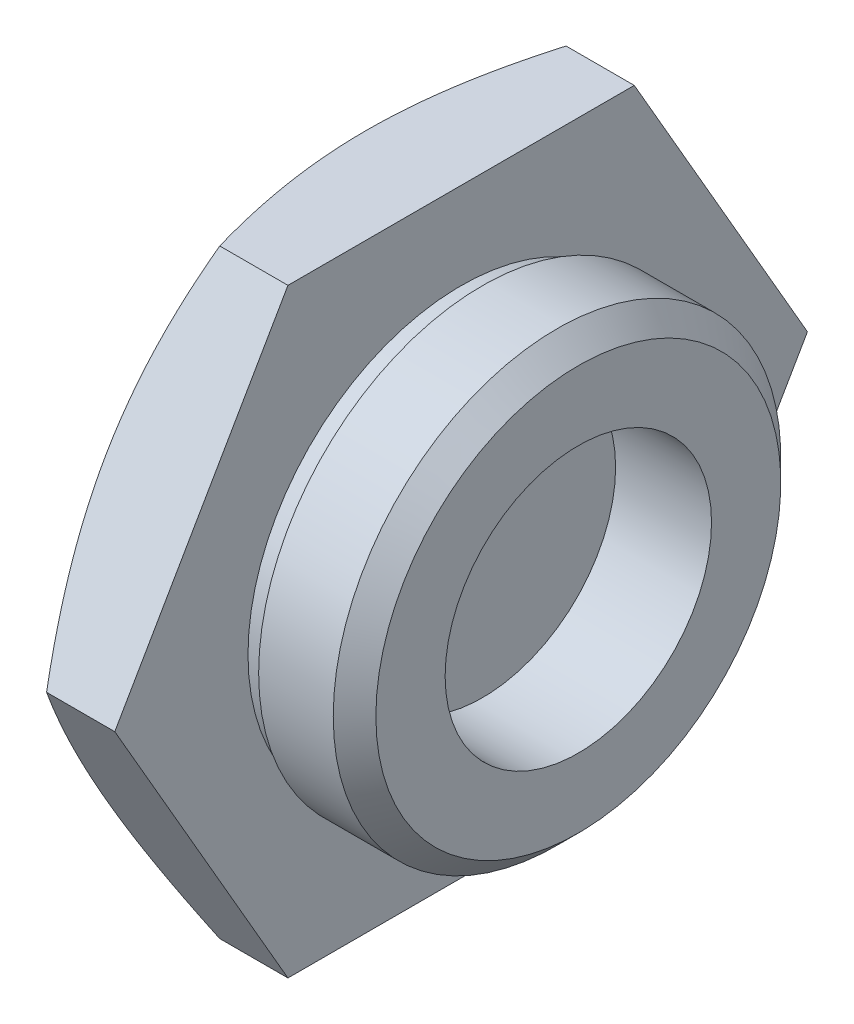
ISO-10303-21;
HEADER;
FILE_DESCRIPTION(('STEP AP214'),'2;1');
FILE_NAME('part.step','',(''),(''),'','','');
FILE_SCHEMA(('AUTOMOTIVE_DESIGN { 1 0 10303 214 1 1 1 1 }'));
ENDSEC;
DATA;
#1=APPLICATION_CONTEXT('core data for automotive mechanical design processes');
#2=APPLICATION_PROTOCOL_DEFINITION('international standard','automotive_design',2000,#1);
#3=PRODUCT_CONTEXT('',#1,'mechanical');
#4=PRODUCT('Part','Part','',(#3));
#5=PRODUCT_RELATED_PRODUCT_CATEGORY('part','',(#4));
#6=PRODUCT_DEFINITION_FORMATION('','',#4);
#7=PRODUCT_DEFINITION_CONTEXT('part definition',#1,'design');
#8=PRODUCT_DEFINITION('design','',#6,#7);
#9=PRODUCT_DEFINITION_SHAPE('','',#8);
#10=(LENGTH_UNIT() NAMED_UNIT(*) SI_UNIT(.MILLI.,.METRE.));
#11=(NAMED_UNIT(*) PLANE_ANGLE_UNIT() SI_UNIT($,.RADIAN.));
#12=(NAMED_UNIT(*) SI_UNIT($,.STERADIAN.) SOLID_ANGLE_UNIT());
#13=UNCERTAINTY_MEASURE_WITH_UNIT(LENGTH_MEASURE(1.E-05),#10,'distance_accuracy_value','');
#14=(GEOMETRIC_REPRESENTATION_CONTEXT(3) GLOBAL_UNCERTAINTY_ASSIGNED_CONTEXT((#13)) GLOBAL_UNIT_ASSIGNED_CONTEXT((#10,
#11,#12)) REPRESENTATION_CONTEXT('',''));
#15=CARTESIAN_POINT('',(0.,0.,0.));
#16=DIRECTION('',(0.,0.,1.));
#17=DIRECTION('',(1.,0.,0.));
#18=AXIS2_PLACEMENT_3D('',#15,#16,#17);
#19=CARTESIAN_POINT('',(-9.,-28.1458256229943,16.25));
#20=DIRECTION('',(0.,0.5,-0.866025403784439));
#21=DIRECTION('',(0.,0.866025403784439,0.5));
#22=AXIS2_PLACEMENT_3D('',#19,#20,#21);
#23=PLANE('',#22);
#24=CARTESIAN_POINT('',(-6.40185712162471,-28.1460256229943,16.2498845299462));
#25=CARTESIAN_POINT('',(-6.60805259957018,-27.5273929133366,16.6070522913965));
#26=CARTESIAN_POINT('',(-6.80489114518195,-26.9063472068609,16.9656131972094));
#27=CARTESIAN_POINT('',(-7.17725349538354,-25.6592757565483,17.685610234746));
#28=CARTESIAN_POINT('',(-7.35277028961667,-25.0332484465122,18.0470472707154));
#29=CARTESIAN_POINT('',(-7.68013328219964,-23.7749905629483,18.773502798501));
#30=CARTESIAN_POINT('',(-7.83192295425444,-23.1427488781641,19.138527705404));
#31=CARTESIAN_POINT('',(-8.10856180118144,-21.8738992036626,19.8710984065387));
#32=CARTESIAN_POINT('',(-8.23341365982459,-21.2372916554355,20.2386439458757));
#33=CARTESIAN_POINT('',(-8.45087711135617,-19.9759824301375,20.9668611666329));
#34=CARTESIAN_POINT('',(-8.5442078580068,-19.3513743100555,21.3274788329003));
#35=CARTESIAN_POINT('',(-8.70070202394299,-18.0992960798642,22.0503665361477));
#36=CARTESIAN_POINT('',(-8.76386486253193,-17.4718259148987,22.412636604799));
#37=CARTESIAN_POINT('',(-8.85842840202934,-16.2158316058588,23.1377852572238));
#38=CARTESIAN_POINT('',(-8.88986684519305,-15.5873096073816,23.5006626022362));
#39=CARTESIAN_POINT('',(-8.92030544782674,-14.3296855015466,24.2267522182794));
#40=CARTESIAN_POINT('',(-8.91930660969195,-13.7005834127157,24.5899644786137));
#41=CARTESIAN_POINT('',(-8.88713665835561,-12.5244700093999,25.2689938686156));
#42=CARTESIAN_POINT('',(-8.85988837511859,-11.9773748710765,25.584859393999));
#43=CARTESIAN_POINT('',(-8.78137645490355,-10.8844893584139,26.2158371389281));
#44=CARTESIAN_POINT('',(-8.73011316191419,-10.3386989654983,26.5309493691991));
#45=CARTESIAN_POINT('',(-8.60446267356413,-9.24863104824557,27.1603003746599));
#46=CARTESIAN_POINT('',(-8.5300545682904,-8.70435534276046,27.4745380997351));
#47=CARTESIAN_POINT('',(-8.35942006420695,-7.61839098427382,28.1015199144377));
#48=CARTESIAN_POINT('',(-8.26319375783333,-7.07670232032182,28.4142640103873));
#49=CARTESIAN_POINT('',(-8.04809475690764,-5.98441167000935,29.0448983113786));
#50=CARTESIAN_POINT('',(-7.9287690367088,-5.43387688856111,29.362749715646));
#51=CARTESIAN_POINT('',(-7.67065480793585,-4.33617685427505,29.9965071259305));
#52=CARTESIAN_POINT('',(-7.53186366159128,-3.78901206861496,30.3124128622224));
#53=CARTESIAN_POINT('',(-7.23691891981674,-2.69933507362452,30.9415381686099));
#54=CARTESIAN_POINT('',(-7.08079929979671,-2.15681593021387,31.2547617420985));
#55=CARTESIAN_POINT('',(-6.75275513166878,-1.07553002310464,31.879042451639));
#56=CARTESIAN_POINT('',(-6.58083503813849,-0.536762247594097,32.1901001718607));
#57=CARTESIAN_POINT('',(-6.40185712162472,0.000199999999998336,32.5001154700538));
#58=B_SPLINE_CURVE_WITH_KNOTS('',3,(#24,#25,#26,#27,#28,#29,#30,#31,#32,#33,#34,#35,#36,#37,#38,
#39,#40,#41,#42,#43,#44,#45,#46,#47,#48,#49,#50,#51,#52,#53,#54,#55,#56,#57),.UNSPECIFIED.,.F.,
.F.,(4,2,2,2,2,2,2,2,2,2,2,2,2,2,2,2,4),(0.,2.23055747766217,4.46184636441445,6.69837250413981,
8.93467571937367,11.1158288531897,13.297023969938,15.4756210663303,17.6541508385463,
19.5506490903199,21.4471201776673,23.3453096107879,25.2434910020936,27.1835745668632,
29.1239212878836,31.0605286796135,32.9965917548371),.UNSPECIFIED.);
#59=CARTESIAN_POINT('',(-6.40192378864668,-28.1458256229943,16.25));
#60=VERTEX_POINT('',#59);
#61=CARTESIAN_POINT('',(-6.40192378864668,0.,32.5));
#62=VERTEX_POINT('',#61);
#63=EDGE_CURVE('E400',#60,#62,#58,.T.);
#64=ORIENTED_EDGE('',*,*,#63,.F.);
#65=DIRECTION('',(1.,0.,0.));
#66=VECTOR('',#65,1.);
#67=CARTESIAN_POINT('',(-9.,-28.1458256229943,16.25));
#68=LINE('',#67,#66);
#69=CARTESIAN_POINT('',(0.,-28.1458256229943,16.25));
#70=VERTEX_POINT('',#69);
#71=EDGE_CURVE('E371',#60,#70,#68,.T.);
#72=ORIENTED_EDGE('',*,*,#71,.T.);
#73=DIRECTION('',(0.,0.866025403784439,0.5));
#74=VECTOR('',#73,1.);
#75=CARTESIAN_POINT('',(0.,-28.1458256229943,16.25));
#76=LINE('',#75,#74);
#77=CARTESIAN_POINT('',(0.,0.,32.5));
#78=VERTEX_POINT('',#77);
#79=EDGE_CURVE('E407',#70,#78,#76,.T.);
#80=ORIENTED_EDGE('',*,*,#79,.T.);
#81=DIRECTION('',(1.,0.,0.));
#82=VECTOR('',#81,1.);
#83=CARTESIAN_POINT('',(-9.,0.,32.5));
#84=LINE('',#83,#82);
#85=EDGE_CURVE('E413',#62,#78,#84,.T.);
#86=ORIENTED_EDGE('',*,*,#85,.F.);
#87=EDGE_LOOP('',(#64,#72,#80,#86));
#88=FACE_BOUND('',#87,.T.);
#89=ADVANCED_FACE('F348',(#88),#23,.F.);
#90=CARTESIAN_POINT('',(-9.,0.,32.5));
#91=DIRECTION('',(0.,-0.5,-0.866025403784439));
#92=DIRECTION('',(0.,0.866025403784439,-0.5));
#93=AXIS2_PLACEMENT_3D('',#90,#91,#92);
#94=PLANE('',#93);
#95=CARTESIAN_POINT('',(-6.40185712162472,-0.000200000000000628,32.5001154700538));
#96=CARTESIAN_POINT('',(-6.60805259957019,0.618432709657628,32.1429477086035));
#97=CARTESIAN_POINT('',(-6.80489114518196,1.23947841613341,31.7843868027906));
#98=CARTESIAN_POINT('',(-7.17725349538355,2.48654986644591,31.064389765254));
#99=CARTESIAN_POINT('',(-7.35277028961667,3.1125771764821,30.7029527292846));
#100=CARTESIAN_POINT('',(-7.68013328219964,4.37083506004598,29.976497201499));
#101=CARTESIAN_POINT('',(-7.83192295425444,5.00307674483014,29.611472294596));
#102=CARTESIAN_POINT('',(-8.10856180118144,6.27192641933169,28.8789015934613));
#103=CARTESIAN_POINT('',(-8.23341365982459,6.90853396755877,28.5113560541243));
#104=CARTESIAN_POINT('',(-8.45087711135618,8.16984319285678,27.7831388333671));
#105=CARTESIAN_POINT('',(-8.5442078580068,8.7944513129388,27.4225211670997));
#106=CARTESIAN_POINT('',(-8.70070202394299,10.04652954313,26.6996334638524));
#107=CARTESIAN_POINT('',(-8.76386486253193,10.6739997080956,26.337363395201));
#108=CARTESIAN_POINT('',(-8.85842840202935,11.9299940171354,25.6122147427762));
#109=CARTESIAN_POINT('',(-8.88986684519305,12.5585160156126,25.2493373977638));
#110=CARTESIAN_POINT('',(-8.92030544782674,13.8161401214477,24.5232477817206));
#111=CARTESIAN_POINT('',(-8.91930660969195,14.4452422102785,24.1600355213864));
#112=CARTESIAN_POINT('',(-8.88713665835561,15.6213556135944,23.4810061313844));
#113=CARTESIAN_POINT('',(-8.85988837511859,16.1684507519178,23.1651406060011));
#114=CARTESIAN_POINT('',(-8.78137645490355,17.2613362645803,22.5341628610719));
#115=CARTESIAN_POINT('',(-8.73011316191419,17.807126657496,22.2190506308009));
#116=CARTESIAN_POINT('',(-8.60446267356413,18.8971945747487,21.5896996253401));
#117=CARTESIAN_POINT('',(-8.5300545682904,19.4414702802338,21.2754619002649));
#118=CARTESIAN_POINT('',(-8.35942006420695,20.5274346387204,20.6484800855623));
#119=CARTESIAN_POINT('',(-8.26319375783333,21.0691233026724,20.3357359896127));
#120=CARTESIAN_POINT('',(-8.04809475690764,22.1614139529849,19.7051016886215));
#121=CARTESIAN_POINT('',(-7.9287690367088,22.7119487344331,19.3872502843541));
#122=CARTESIAN_POINT('',(-7.67065480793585,23.8096487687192,18.7534928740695));
#123=CARTESIAN_POINT('',(-7.53186366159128,24.3568135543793,18.4375871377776));
#124=CARTESIAN_POINT('',(-7.23691891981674,25.4464905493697,17.8084618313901));
#125=CARTESIAN_POINT('',(-7.0807992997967,25.9890096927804,17.4952382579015));
#126=CARTESIAN_POINT('',(-6.75275513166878,27.0702955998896,16.870957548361));
#127=CARTESIAN_POINT('',(-6.58083503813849,27.6090633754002,16.5598998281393));
#128=CARTESIAN_POINT('',(-6.40185712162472,28.1460256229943,16.2498845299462));
#129=B_SPLINE_CURVE_WITH_KNOTS('',3,(#95,#96,#97,#98,#99,#100,#101,#102,#103,#104,#105,#106,
#107,#108,#109,#110,#111,#112,#113,#114,#115,#116,#117,#118,#119,#120,#121,#122,#123,#124,#125,
#126,#127,#128),.UNSPECIFIED.,.F.,.F.,(4,2,2,2,2,2,2,2,2,2,2,2,2,2,2,2,4),(0.,2.23055747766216,
4.46184636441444,6.69837250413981,8.93467571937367,11.1158288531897,13.297023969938,
15.4756210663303,17.6541508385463,19.5506490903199,21.4471201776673,23.3453096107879,
25.2434910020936,27.1835745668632,29.1239212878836,31.0605286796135,32.9965917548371),.UNSPECIFIED.);
#130=CARTESIAN_POINT('',(-6.40192378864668,28.1458256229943,16.25));
#131=VERTEX_POINT('',#130);
#132=EDGE_CURVE('E403',#62,#131,#129,.T.);
#133=ORIENTED_EDGE('',*,*,#132,.F.);
#134=ORIENTED_EDGE('',*,*,#85,.T.);
#135=DIRECTION('',(0.,0.866025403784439,-0.5));
#136=VECTOR('',#135,1.);
#137=CARTESIAN_POINT('',(0.,0.,32.5));
#138=LINE('',#137,#136);
#139=CARTESIAN_POINT('',(0.,28.1458256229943,16.25));
#140=VERTEX_POINT('',#139);
#141=EDGE_CURVE('E554',#78,#140,#138,.T.);
#142=ORIENTED_EDGE('',*,*,#141,.T.);
#143=DIRECTION('',(1.,0.,0.));
#144=VECTOR('',#143,1.);
#145=CARTESIAN_POINT('',(-9.,28.1458256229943,16.25));
#146=LINE('',#145,#144);
#147=EDGE_CURVE('E415',#131,#140,#146,.T.);
#148=ORIENTED_EDGE('',*,*,#147,.F.);
#149=EDGE_LOOP('',(#133,#134,#142,#148));
#150=FACE_BOUND('',#149,.T.);
#151=ADVANCED_FACE('F411',(#150),#94,.F.);
#152=CARTESIAN_POINT('',(-9.,28.1458256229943,16.25));
#153=DIRECTION('',(0.,-1.,0.));
#154=DIRECTION('',(0.,0.,-1.));
#155=AXIS2_PLACEMENT_3D('',#152,#153,#154);
#156=PLANE('',#155);
#157=CARTESIAN_POINT('',(4.54707751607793,28.1458256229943,-43.085718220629));
#158=CARTESIAN_POINT('',(4.24846355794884,28.1458256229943,-42.4679064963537));
#159=CARTESIAN_POINT('',(3.95139146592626,28.1458256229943,-41.849347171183));
#160=CARTESIAN_POINT('',(3.36069509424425,28.1458256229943,-40.610576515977));
#161=CARTESIAN_POINT('',(3.06707085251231,28.1458256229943,-39.9903651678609));
#162=CARTESIAN_POINT('',(2.48359128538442,28.1458256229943,-38.7480417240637));
#163=CARTESIAN_POINT('',(2.19373660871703,28.1458256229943,-38.1259293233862));
#164=CARTESIAN_POINT('',(1.6182861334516,28.1458256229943,-36.8797407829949));
#165=CARTESIAN_POINT('',(1.3326903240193,28.1458256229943,-36.2556646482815));
#166=CARTESIAN_POINT('',(0.47975973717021,28.1458256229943,-34.3730506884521));
#167=CARTESIAN_POINT('',(-0.0803677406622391,28.1458256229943,-33.1112333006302));
#168=CARTESIAN_POINT('',(-1.17658001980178,28.1458256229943,-30.5772186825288));
#169=CARTESIAN_POINT('',(-1.71266607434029,28.1458256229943,-29.305021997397));
#170=CARTESIAN_POINT('',(-2.49704866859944,28.1458256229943,-27.3795510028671));
#171=CARTESIAN_POINT('',(-2.75672107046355,28.1458256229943,-26.7309060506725));
#172=CARTESIAN_POINT('',(-3.26716860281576,28.1458256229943,-25.4301291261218));
#173=CARTESIAN_POINT('',(-3.51794387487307,28.1458256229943,-24.7779972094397));
#174=CARTESIAN_POINT('',(-4.00944966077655,28.1458256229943,-23.469843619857));
#175=CARTESIAN_POINT('',(-4.25017871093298,28.1458256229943,-22.8138213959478));
#176=CARTESIAN_POINT('',(-4.72017986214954,28.1458256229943,-21.4976964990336));
#177=CARTESIAN_POINT('',(-4.94945222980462,28.1458256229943,-20.8375939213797));
#178=CARTESIAN_POINT('',(-5.39452069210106,28.1458256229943,-19.5144144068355));
#179=CARTESIAN_POINT('',(-5.61034462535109,28.1458256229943,-18.8513468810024));
#180=CARTESIAN_POINT('',(-6.02729981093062,28.1458256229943,-17.5206216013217));
#181=CARTESIAN_POINT('',(-6.22843081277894,28.1458256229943,-16.8529637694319));
#182=CARTESIAN_POINT('',(-6.80683226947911,28.1458256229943,-14.8431119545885));
#183=CARTESIAN_POINT('',(-7.15928578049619,28.1458256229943,-13.4935294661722));
#184=CARTESIAN_POINT('',(-7.62530125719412,28.1458256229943,-11.4546871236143));
#185=CARTESIAN_POINT('',(-7.77021988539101,28.1458256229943,-10.7725142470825));
#186=CARTESIAN_POINT('',(-8.03687935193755,28.1458256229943,-9.40362466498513));
#187=CARTESIAN_POINT('',(-8.15862071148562,28.1458256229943,-8.71690806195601));
#188=CARTESIAN_POINT('',(-8.3767665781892,28.1458256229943,-7.33940027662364));
#189=CARTESIAN_POINT('',(-8.473169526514,28.1458256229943,-6.64860884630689));
#190=CARTESIAN_POINT('',(-8.63870192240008,28.1458256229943,-5.26374187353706));
#191=CARTESIAN_POINT('',(-8.7078313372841,28.1458256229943,-4.5696663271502));
#192=CARTESIAN_POINT('',(-8.81695625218,28.1458256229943,-3.18364321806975));
#193=CARTESIAN_POINT('',(-8.85713374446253,28.1458256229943,-2.49171007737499));
#194=CARTESIAN_POINT('',(-8.90814374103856,28.1458256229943,-1.10676625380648));
#195=CARTESIAN_POINT('',(-8.91897668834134,28.1458256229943,-0.413755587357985));
#196=CARTESIAN_POINT('',(-8.91104081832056,28.1458256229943,0.97190742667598));
#197=CARTESIAN_POINT('',(-8.8922801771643,28.1458256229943,1.66455982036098));
#198=CARTESIAN_POINT('',(-8.82562297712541,28.1458256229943,3.04846635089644));
#199=CARTESIAN_POINT('',(-8.77772513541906,28.1458256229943,3.73972042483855));
#200=CARTESIAN_POINT('',(-8.62733617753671,28.1458256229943,5.41496716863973));
#201=CARTESIAN_POINT('',(-8.51025536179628,28.1458256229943,6.39767150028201));
#202=CARTESIAN_POINT('',(-8.22372160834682,28.1458256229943,8.35542508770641));
#203=CARTESIAN_POINT('',(-8.05426089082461,28.1458256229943,9.33047318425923));
#204=CARTESIAN_POINT('',(-7.6687321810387,28.1458256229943,11.2734137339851));
#205=CARTESIAN_POINT('',(-7.45256425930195,28.1458256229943,12.2412861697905));
#206=CARTESIAN_POINT('',(-6.98033302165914,28.1458256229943,14.1671181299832));
#207=CARTESIAN_POINT('',(-6.72427120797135,28.1458256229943,15.1250780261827));
#208=CARTESIAN_POINT('',(-6.17198279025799,28.1458256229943,17.0536286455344));
#209=CARTESIAN_POINT('',(-5.87495469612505,28.1458256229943,18.0239882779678));
#210=CARTESIAN_POINT('',(-5.25135107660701,28.1458256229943,19.9552011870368));
#211=CARTESIAN_POINT('',(-4.92477288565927,28.1458256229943,20.9160535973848));
#212=CARTESIAN_POINT('',(-4.24897540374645,28.1458256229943,22.8236310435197));
#213=CARTESIAN_POINT('',(-3.89989422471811,28.1458256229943,23.7704051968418));
#214=CARTESIAN_POINT('',(-3.3611728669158,28.1458256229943,25.1845980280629));
#215=CARTESIAN_POINT('',(-3.17911289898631,28.1458256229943,25.6549259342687));
#216=CARTESIAN_POINT('',(-2.81036924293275,28.1458256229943,26.5937511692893));
#217=CARTESIAN_POINT('',(-2.62368568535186,28.1458256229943,27.062248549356));
#218=CARTESIAN_POINT('',(-2.43489789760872,28.1458256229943,27.5298975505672));
#219=B_SPLINE_CURVE_WITH_KNOTS('',3,(#157,#158,#159,#160,#161,#162,#163,#164,#165,#166,#167,
#168,#169,#170,#171,#172,#173,#174,#175,#176,#177,#178,#179,#180,#181,#182,#183,#184,#185,#186,
#187,#188,#189,#190,#191,#192,#193,#194,#195,#196,#197,#198,#199,#200,#201,#202,#203,#204,#205,
#206,#207,#208,#209,#210,#211,#212,#213,#214,#215,#216,#217,#218),.UNSPECIFIED.,.F.,.F.,(4,2,2,
2,2,2,2,2,2,2,2,2,2,2,2,2,2,2,2,2,2,2,2,2,2,2,2,2,2,2,4),(0.,2.05858160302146,4.11718582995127,
6.17613976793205,8.23508846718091,12.3765523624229,16.5178001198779,18.6138219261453,
20.7098103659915,22.8061031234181,24.9023470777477,26.9940967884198,29.0858821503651,
33.2678365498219,35.3597080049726,37.4515324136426,39.5434854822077,41.6354410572,
43.7141290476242,45.7927856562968,47.870868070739,49.9490419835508,52.9163528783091,
55.8841047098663,58.8582700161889,61.8323233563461,64.8761641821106,67.9202798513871,
70.9472234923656,72.4602099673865,73.9731537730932),.UNSPECIFIED.);
#220=CARTESIAN_POINT('',(-6.40192378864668,28.1458256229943,-16.25));
#221=VERTEX_POINT('',#220);
#222=EDGE_CURVE('E416',#131,#221,#219,.F.);
#223=ORIENTED_EDGE('',*,*,#222,.F.);
#224=ORIENTED_EDGE('',*,*,#147,.T.);
#225=DIRECTION('',(0.,0.,-1.));
#226=VECTOR('',#225,1.);
#227=CARTESIAN_POINT('',(0.,28.1458256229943,16.25));
#228=LINE('',#227,#226);
#229=CARTESIAN_POINT('',(0.,28.1458256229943,-16.25));
#230=VERTEX_POINT('',#229);
#231=EDGE_CURVE('E552',#140,#230,#228,.T.);
#232=ORIENTED_EDGE('',*,*,#231,.T.);
#233=DIRECTION('',(1.,0.,0.));
#234=VECTOR('',#233,1.);
#235=CARTESIAN_POINT('',(-9.,28.1458256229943,-16.25));
#236=LINE('',#235,#234);
#237=EDGE_CURVE('E424',#221,#230,#236,.T.);
#238=ORIENTED_EDGE('',*,*,#237,.F.);
#239=EDGE_LOOP('',(#223,#224,#232,#238));
#240=FACE_BOUND('',#239,.T.);
#241=ADVANCED_FACE('F465',(#240),#156,.F.);
#242=CARTESIAN_POINT('',(-9.,28.1458256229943,-16.25));
#243=DIRECTION('',(0.,-0.5,0.866025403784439));
#244=DIRECTION('',(0.,-0.866025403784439,-0.5));
#245=AXIS2_PLACEMENT_3D('',#242,#243,#244);
#246=PLANE('',#245);
#247=CARTESIAN_POINT('',(-6.40185712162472,28.1460256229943,-16.2498845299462));
#248=CARTESIAN_POINT('',(-6.60805259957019,27.5273929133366,-16.6070522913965));
#249=CARTESIAN_POINT('',(-6.80489114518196,26.9063472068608,-16.9656131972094));
#250=CARTESIAN_POINT('',(-7.17725349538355,25.6592757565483,-17.685610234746));
#251=CARTESIAN_POINT('',(-7.35277028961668,25.0332484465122,-18.0470472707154));
#252=CARTESIAN_POINT('',(-7.68013328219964,23.7749905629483,-18.773502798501));
#253=CARTESIAN_POINT('',(-7.83192295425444,23.1427488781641,-19.138527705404));
#254=CARTESIAN_POINT('',(-8.10856180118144,21.8738992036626,-19.8710984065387));
#255=CARTESIAN_POINT('',(-8.2334136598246,21.2372916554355,-20.2386439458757));
#256=CARTESIAN_POINT('',(-8.45087711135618,19.9759824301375,-20.9668611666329));
#257=CARTESIAN_POINT('',(-8.5442078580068,19.3513743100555,-21.3274788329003));
#258=CARTESIAN_POINT('',(-8.70070202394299,18.0992960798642,-22.0503665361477));
#259=CARTESIAN_POINT('',(-8.76386486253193,17.4718259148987,-22.412636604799));
#260=CARTESIAN_POINT('',(-8.85842840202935,16.2158316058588,-23.1377852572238));
#261=CARTESIAN_POINT('',(-8.88986684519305,15.5873096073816,-23.5006626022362));
#262=CARTESIAN_POINT('',(-8.92030544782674,14.3296855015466,-24.2267522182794));
#263=CARTESIAN_POINT('',(-8.91930660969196,13.7005834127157,-24.5899644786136));
#264=CARTESIAN_POINT('',(-8.88713665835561,12.5244700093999,-25.2689938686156));
#265=CARTESIAN_POINT('',(-8.85988837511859,11.9773748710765,-25.5848593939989));
#266=CARTESIAN_POINT('',(-8.78137645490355,10.8844893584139,-26.2158371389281));
#267=CARTESIAN_POINT('',(-8.7301131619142,10.3386989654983,-26.5309493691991));
#268=CARTESIAN_POINT('',(-8.60446267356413,9.24863104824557,-27.1603003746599));
#269=CARTESIAN_POINT('',(-8.5300545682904,8.70435534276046,-27.4745380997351));
#270=CARTESIAN_POINT('',(-8.35942006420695,7.61839098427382,-28.1015199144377));
#271=CARTESIAN_POINT('',(-8.26319375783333,7.07670232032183,-28.4142640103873));
#272=CARTESIAN_POINT('',(-8.04809475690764,5.98441167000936,-29.0448983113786));
#273=CARTESIAN_POINT('',(-7.9287690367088,5.43387688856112,-29.362749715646));
#274=CARTESIAN_POINT('',(-7.67065480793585,4.33617685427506,-29.9965071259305));
#275=CARTESIAN_POINT('',(-7.53186366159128,3.78901206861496,-30.3124128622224));
#276=CARTESIAN_POINT('',(-7.23691891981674,2.69933507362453,-30.9415381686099));
#277=CARTESIAN_POINT('',(-7.08079929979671,2.15681593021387,-31.2547617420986));
#278=CARTESIAN_POINT('',(-6.75275513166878,1.07553002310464,-31.879042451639));
#279=CARTESIAN_POINT('',(-6.58083503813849,0.536762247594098,-32.1901001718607));
#280=CARTESIAN_POINT('',(-6.40185712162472,-0.00019999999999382,-32.5001154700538));
#281=B_SPLINE_CURVE_WITH_KNOTS('',3,(#247,#248,#249,#250,#251,#252,#253,#254,#255,#256,#257,
#258,#259,#260,#261,#262,#263,#264,#265,#266,#267,#268,#269,#270,#271,#272,#273,#274,#275,#276,
#277,#278,#279,#280),.UNSPECIFIED.,.F.,.F.,(4,2,2,2,2,2,2,2,2,2,2,2,2,2,2,2,4),(0.,
2.23055747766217,4.46184636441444,6.69837250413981,8.93467571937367,11.1158288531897,
13.297023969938,15.4756210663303,17.6541508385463,19.5506490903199,21.4471201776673,
23.3453096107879,25.2434910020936,27.1835745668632,29.1239212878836,31.0605286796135,
32.9965917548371),.UNSPECIFIED.);
#282=CARTESIAN_POINT('',(-6.40192378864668,0.,-32.5));
#283=VERTEX_POINT('',#282);
#284=EDGE_CURVE('E502',#221,#283,#281,.T.);
#285=ORIENTED_EDGE('',*,*,#284,.F.);
#286=ORIENTED_EDGE('',*,*,#237,.T.);
#287=DIRECTION('',(0.,-0.866025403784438,-0.5));
#288=VECTOR('',#287,1.);
#289=CARTESIAN_POINT('',(0.,28.1458256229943,-16.25));
#290=LINE('',#289,#288);
#291=CARTESIAN_POINT('',(0.,0.,-32.5));
#292=VERTEX_POINT('',#291);
#293=EDGE_CURVE('E541',#230,#292,#290,.T.);
#294=ORIENTED_EDGE('',*,*,#293,.T.);
#295=DIRECTION('',(1.,0.,0.));
#296=VECTOR('',#295,1.);
#297=CARTESIAN_POINT('',(-9.,0.,-32.5));
#298=LINE('',#297,#296);
#299=EDGE_CURVE('E537',#283,#292,#298,.T.);
#300=ORIENTED_EDGE('',*,*,#299,.F.);
#301=EDGE_LOOP('',(#285,#286,#294,#300));
#302=FACE_BOUND('',#301,.T.);
#303=ADVANCED_FACE('F512',(#302),#246,.F.);
#304=CARTESIAN_POINT('',(-9.,0.,-32.5));
#305=DIRECTION('',(0.,0.5,0.866025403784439));
#306=DIRECTION('',(0.,-0.866025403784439,0.5));
#307=AXIS2_PLACEMENT_3D('',#304,#305,#306);
#308=PLANE('',#307);
#309=CARTESIAN_POINT('',(-6.40185712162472,0.000200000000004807,-32.5001154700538));
#310=CARTESIAN_POINT('',(-6.60805259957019,-0.618432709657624,-32.1429477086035));
#311=CARTESIAN_POINT('',(-6.80489114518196,-1.2394784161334,-31.7843868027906));
#312=CARTESIAN_POINT('',(-7.17725349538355,-2.48654986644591,-31.064389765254));
#313=CARTESIAN_POINT('',(-7.35277028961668,-3.11257717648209,-30.7029527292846));
#314=CARTESIAN_POINT('',(-7.68013328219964,-4.37083506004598,-29.976497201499));
#315=CARTESIAN_POINT('',(-7.83192295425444,-5.00307674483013,-29.611472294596));
#316=CARTESIAN_POINT('',(-8.10856180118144,-6.27192641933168,-28.8789015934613));
#317=CARTESIAN_POINT('',(-8.23341365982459,-6.90853396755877,-28.5113560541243));
#318=CARTESIAN_POINT('',(-8.45087711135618,-8.16984319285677,-27.7831388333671));
#319=CARTESIAN_POINT('',(-8.5442078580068,-8.79445131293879,-27.4225211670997));
#320=CARTESIAN_POINT('',(-8.70070202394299,-10.04652954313,-26.6996334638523));
#321=CARTESIAN_POINT('',(-8.76386486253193,-10.6739997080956,-26.337363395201));
#322=CARTESIAN_POINT('',(-8.85842840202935,-11.9299940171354,-25.6122147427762));
#323=CARTESIAN_POINT('',(-8.88986684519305,-12.5585160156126,-25.2493373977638));
#324=CARTESIAN_POINT('',(-8.92030544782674,-13.8161401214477,-24.5232477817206));
#325=CARTESIAN_POINT('',(-8.91930660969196,-14.4452422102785,-24.1600355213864));
#326=CARTESIAN_POINT('',(-8.88713665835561,-15.6213556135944,-23.4810061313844));
#327=CARTESIAN_POINT('',(-8.85988837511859,-16.1684507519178,-23.1651406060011));
#328=CARTESIAN_POINT('',(-8.78137645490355,-17.2613362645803,-22.5341628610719));
#329=CARTESIAN_POINT('',(-8.7301131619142,-17.807126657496,-22.2190506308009));
#330=CARTESIAN_POINT('',(-8.60446267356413,-18.8971945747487,-21.5896996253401));
#331=CARTESIAN_POINT('',(-8.5300545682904,-19.4414702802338,-21.2754619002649));
#332=CARTESIAN_POINT('',(-8.35942006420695,-20.5274346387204,-20.6484800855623));
#333=CARTESIAN_POINT('',(-8.26319375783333,-21.0691233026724,-20.3357359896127));
#334=CARTESIAN_POINT('',(-8.04809475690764,-22.1614139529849,-19.7051016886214));
#335=CARTESIAN_POINT('',(-7.9287690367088,-22.7119487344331,-19.3872502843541));
#336=CARTESIAN_POINT('',(-7.67065480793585,-23.8096487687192,-18.7534928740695));
#337=CARTESIAN_POINT('',(-7.53186366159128,-24.3568135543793,-18.4375871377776));
#338=CARTESIAN_POINT('',(-7.23691891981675,-25.4464905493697,-17.8084618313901));
#339=CARTESIAN_POINT('',(-7.08079929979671,-25.9890096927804,-17.4952382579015));
#340=CARTESIAN_POINT('',(-6.75275513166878,-27.0702955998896,-16.870957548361));
#341=CARTESIAN_POINT('',(-6.58083503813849,-27.6090633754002,-16.5598998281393));
#342=CARTESIAN_POINT('',(-6.40185712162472,-28.1460256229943,-16.2498845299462));
#343=B_SPLINE_CURVE_WITH_KNOTS('',3,(#309,#310,#311,#312,#313,#314,#315,#316,#317,#318,#319,
#320,#321,#322,#323,#324,#325,#326,#327,#328,#329,#330,#331,#332,#333,#334,#335,#336,#337,#338,
#339,#340,#341,#342),.UNSPECIFIED.,.F.,.F.,(4,2,2,2,2,2,2,2,2,2,2,2,2,2,2,2,4),(0.,
2.23055747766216,4.46184636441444,6.69837250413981,8.93467571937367,11.1158288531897,
13.297023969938,15.4756210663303,17.6541508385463,19.5506490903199,21.4471201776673,
23.3453096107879,25.2434910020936,27.1835745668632,29.1239212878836,31.0605286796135,
32.9965917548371),.UNSPECIFIED.);
#344=CARTESIAN_POINT('',(-6.40192378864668,-28.1458256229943,-16.25));
#345=VERTEX_POINT('',#344);
#346=EDGE_CURVE('E363',#283,#345,#343,.T.);
#347=ORIENTED_EDGE('',*,*,#346,.F.);
#348=ORIENTED_EDGE('',*,*,#299,.T.);
#349=DIRECTION('',(0.,-0.866025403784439,0.5));
#350=VECTOR('',#349,1.);
#351=CARTESIAN_POINT('',(0.,0.,-32.5));
#352=LINE('',#351,#350);
#353=CARTESIAN_POINT('',(0.,-28.1458256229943,-16.25));
#354=VERTEX_POINT('',#353);
#355=EDGE_CURVE('E549',#292,#354,#352,.T.);
#356=ORIENTED_EDGE('',*,*,#355,.T.);
#357=DIRECTION('',(1.,0.,0.));
#358=VECTOR('',#357,1.);
#359=CARTESIAN_POINT('',(-9.,-28.1458256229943,-16.25));
#360=LINE('',#359,#358);
#361=EDGE_CURVE('E539',#345,#354,#360,.T.);
#362=ORIENTED_EDGE('',*,*,#361,.F.);
#363=EDGE_LOOP('',(#347,#348,#356,#362));
#364=FACE_BOUND('',#363,.T.);
#365=ADVANCED_FACE('F516',(#364),#308,.F.);
#366=CARTESIAN_POINT('',(-9.,-28.1458256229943,-16.25));
#367=DIRECTION('',(0.,1.,0.));
#368=DIRECTION('',(0.,0.,1.));
#369=AXIS2_PLACEMENT_3D('',#366,#367,#368);
#370=PLANE('',#369);
#371=CARTESIAN_POINT('',(4.5470775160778,-28.1458256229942,-43.0857182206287));
#372=CARTESIAN_POINT('',(4.2484635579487,-28.1458256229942,-42.4679064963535));
#373=CARTESIAN_POINT('',(3.95139146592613,-28.1458256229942,-41.8493471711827));
#374=CARTESIAN_POINT('',(3.36069509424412,-28.1458256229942,-40.6105765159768));
#375=CARTESIAN_POINT('',(3.06707085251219,-28.1458256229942,-39.9903651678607));
#376=CARTESIAN_POINT('',(2.4835912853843,-28.1458256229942,-38.7480417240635));
#377=CARTESIAN_POINT('',(2.19373660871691,-28.1458256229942,-38.125929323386));
#378=CARTESIAN_POINT('',(1.61828613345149,-28.1458256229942,-36.8797407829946));
#379=CARTESIAN_POINT('',(1.33269032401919,-28.1458256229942,-36.2556646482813));
#380=CARTESIAN_POINT('',(0.479759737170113,-28.1458256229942,-34.3730506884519));
#381=CARTESIAN_POINT('',(-0.0803677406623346,-28.1458256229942,-33.11123330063));
#382=CARTESIAN_POINT('',(-1.17658001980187,-28.1458256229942,-30.5772186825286));
#383=CARTESIAN_POINT('',(-1.71266607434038,-28.1458256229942,-29.3050219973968));
#384=CARTESIAN_POINT('',(-2.49704866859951,-28.1458256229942,-27.379551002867));
#385=CARTESIAN_POINT('',(-2.75672107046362,-28.1458256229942,-26.7309060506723));
#386=CARTESIAN_POINT('',(-3.26716860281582,-28.1458256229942,-25.4301291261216));
#387=CARTESIAN_POINT('',(-3.51794387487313,-28.1458256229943,-24.7779972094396));
#388=CARTESIAN_POINT('',(-4.00944966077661,-28.1458256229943,-23.4698436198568));
#389=CARTESIAN_POINT('',(-4.25017871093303,-28.1458256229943,-22.8138213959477));
#390=CARTESIAN_POINT('',(-4.72017986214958,-28.1458256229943,-21.4976964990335));
#391=CARTESIAN_POINT('',(-4.94945222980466,-28.1458256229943,-20.8375939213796));
#392=CARTESIAN_POINT('',(-5.3945206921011,-28.1458256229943,-19.5144144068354));
#393=CARTESIAN_POINT('',(-5.61034462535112,-28.1458256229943,-18.8513468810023));
#394=CARTESIAN_POINT('',(-6.02729981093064,-28.1458256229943,-17.5206216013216));
#395=CARTESIAN_POINT('',(-6.22843081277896,-28.1458256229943,-16.8529637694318));
#396=CARTESIAN_POINT('',(-6.80683226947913,-28.1458256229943,-14.8431119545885));
#397=CARTESIAN_POINT('',(-7.1592857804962,-28.1458256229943,-13.4935294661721));
#398=CARTESIAN_POINT('',(-7.62530125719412,-28.1458256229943,-11.4546871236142));
#399=CARTESIAN_POINT('',(-7.77021988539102,-28.1458256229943,-10.7725142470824));
#400=CARTESIAN_POINT('',(-8.03687935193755,-28.1458256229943,-9.40362466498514));
#401=CARTESIAN_POINT('',(-8.15862071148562,-28.1458256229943,-8.71690806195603));
#402=CARTESIAN_POINT('',(-8.3767665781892,-28.1458256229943,-7.33940027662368));
#403=CARTESIAN_POINT('',(-8.47316952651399,-28.1458256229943,-6.64860884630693));
#404=CARTESIAN_POINT('',(-8.63870192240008,-28.1458256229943,-5.26374187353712));
#405=CARTESIAN_POINT('',(-8.70783133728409,-28.1458256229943,-4.56966632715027));
#406=CARTESIAN_POINT('',(-8.81695625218,-28.1458256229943,-3.18364321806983));
#407=CARTESIAN_POINT('',(-8.85713374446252,-28.1458256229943,-2.49171007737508));
#408=CARTESIAN_POINT('',(-8.90814374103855,-28.1458256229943,-1.10676625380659));
#409=CARTESIAN_POINT('',(-8.91897668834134,-28.1458256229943,-0.413755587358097));
#410=CARTESIAN_POINT('',(-8.91104081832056,-28.1458256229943,0.971907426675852));
#411=CARTESIAN_POINT('',(-8.8922801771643,-28.1458256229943,1.66455982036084));
#412=CARTESIAN_POINT('',(-8.82562297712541,-28.1458256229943,3.04846635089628));
#413=CARTESIAN_POINT('',(-8.77772513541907,-28.1458256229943,3.73972042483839));
#414=CARTESIAN_POINT('',(-8.62733617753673,-28.1458256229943,5.41496716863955));
#415=CARTESIAN_POINT('',(-8.51025536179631,-28.1458256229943,6.39767150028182));
#416=CARTESIAN_POINT('',(-8.22372160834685,-28.1458256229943,8.35542508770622));
#417=CARTESIAN_POINT('',(-8.05426089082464,-28.1458256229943,9.33047318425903));
#418=CARTESIAN_POINT('',(-7.66873218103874,-28.1458256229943,11.2734137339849));
#419=CARTESIAN_POINT('',(-7.452564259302,-28.1458256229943,12.2412861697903));
#420=CARTESIAN_POINT('',(-6.98033302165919,-28.1458256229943,14.1671181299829));
#421=CARTESIAN_POINT('',(-6.7242712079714,-28.1458256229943,15.1250780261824));
#422=CARTESIAN_POINT('',(-6.17198279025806,-28.1458256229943,17.0536286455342));
#423=CARTESIAN_POINT('',(-5.87495469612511,-28.1458256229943,18.0239882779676));
#424=CARTESIAN_POINT('',(-5.25135107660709,-28.1458256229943,19.9552011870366));
#425=CARTESIAN_POINT('',(-4.92477288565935,-28.1458256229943,20.9160535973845));
#426=CARTESIAN_POINT('',(-4.24897540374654,-28.1458256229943,22.8236310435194));
#427=CARTESIAN_POINT('',(-3.89989422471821,-28.1458256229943,23.7704051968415));
#428=CARTESIAN_POINT('',(-3.36117286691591,-28.1458256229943,25.1845980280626));
#429=CARTESIAN_POINT('',(-3.17911289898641,-28.1458256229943,25.6549259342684));
#430=CARTESIAN_POINT('',(-2.81036924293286,-28.1458256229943,26.593751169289));
#431=CARTESIAN_POINT('',(-2.62368568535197,-28.1458256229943,27.0622485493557));
#432=CARTESIAN_POINT('',(-2.43489789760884,-28.1458256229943,27.5298975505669));
#433=B_SPLINE_CURVE_WITH_KNOTS('',3,(#371,#372,#373,#374,#375,#376,#377,#378,#379,#380,#381,
#382,#383,#384,#385,#386,#387,#388,#389,#390,#391,#392,#393,#394,#395,#396,#397,#398,#399,#400,
#401,#402,#403,#404,#405,#406,#407,#408,#409,#410,#411,#412,#413,#414,#415,#416,#417,#418,#419,
#420,#421,#422,#423,#424,#425,#426,#427,#428,#429,#430,#431,#432),.UNSPECIFIED.,.F.,.F.,(4,2,2,
2,2,2,2,2,2,2,2,2,2,2,2,2,2,2,2,2,2,2,2,2,2,2,2,2,2,2,4),(0.,2.05858160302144,4.11718582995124,
6.17613976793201,8.23508846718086,12.3765523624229,16.5178001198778,18.6138219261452,
20.7098103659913,22.8061031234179,24.9023470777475,26.9940967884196,29.0858821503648,
33.2678365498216,35.3597080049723,37.4515324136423,39.5434854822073,41.6354410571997,
43.7141290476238,45.7927856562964,47.8708680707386,49.9490419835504,52.9163528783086,
55.8841047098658,58.8582700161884,61.8323233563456,64.8761641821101,67.9202798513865,
70.947223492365,72.4602099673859,73.9731537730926),.UNSPECIFIED.);
#434=EDGE_CURVE('E405',#345,#60,#433,.T.);
#435=ORIENTED_EDGE('',*,*,#434,.F.);
#436=ORIENTED_EDGE('',*,*,#361,.T.);
#437=DIRECTION('',(0.,0.,1.));
#438=VECTOR('',#437,1.);
#439=CARTESIAN_POINT('',(0.,-28.1458256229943,-16.25));
#440=LINE('',#439,#438);
#441=EDGE_CURVE('E547',#354,#70,#440,.T.);
#442=ORIENTED_EDGE('',*,*,#441,.T.);
#443=ORIENTED_EDGE('',*,*,#71,.F.);
#444=EDGE_LOOP('',(#435,#436,#442,#443));
#445=FACE_BOUND('',#444,.T.);
#446=ADVANCED_FACE('F520',(#445),#370,.F.);
#447=CARTESIAN_POINT('',(0.,0.,0.));
#448=DIRECTION('',(-1.,0.,0.));
#449=DIRECTION('',(0.,0.,1.));
#450=AXIS2_PLACEMENT_3D('',#447,#448,#449);
#451=CYLINDRICAL_SURFACE('',#450,20.);
#452=CARTESIAN_POINT('',(0.,0.,0.));
#453=DIRECTION('',(-1.,0.,0.));
#454=DIRECTION('',(0.,0.,1.));
#455=AXIS2_PLACEMENT_3D('',#452,#453,#454);
#456=CIRCLE('',#455,20.);
#457=CARTESIAN_POINT('',(0.,0.,20.));
#458=VERTEX_POINT('',#457);
#459=EDGE_CURVE('E436',#458,#458,#456,.T.);
#460=ORIENTED_EDGE('',*,*,#459,.F.);
#461=EDGE_LOOP('',(#460));
#462=FACE_BOUND('',#461,.T.);
#463=CARTESIAN_POINT('',(1.99999999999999,0.,0.));
#464=DIRECTION('',(-1.,0.,0.));
#465=DIRECTION('',(0.,0.,1.));
#466=AXIS2_PLACEMENT_3D('',#463,#464,#465);
#467=CIRCLE('',#466,20.);
#468=CARTESIAN_POINT('',(1.99999999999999,0.,20.));
#469=VERTEX_POINT('',#468);
#470=EDGE_CURVE('E433',#469,#469,#467,.T.);
#471=ORIENTED_EDGE('',*,*,#470,.T.);
#472=EDGE_LOOP('',(#471));
#473=FACE_BOUND('',#472,.T.);
#474=ADVANCED_FACE('F350',(#462,#473),#451,.T.);
#475=CARTESIAN_POINT('',(1.99999999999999,20.,0.));
#476=DIRECTION('',(1.,0.,0.));
#477=DIRECTION('',(0.,0.,-1.));
#478=AXIS2_PLACEMENT_3D('',#475,#476,#477);
#479=PLANE('',#478);
#480=ORIENTED_EDGE('',*,*,#470,.F.);
#481=EDGE_LOOP('',(#480));
#482=FACE_BOUND('',#481,.T.);
#483=CARTESIAN_POINT('',(1.99999999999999,0.,0.));
#484=DIRECTION('',(-1.,0.,0.));
#485=DIRECTION('',(0.,0.,1.));
#486=AXIS2_PLACEMENT_3D('',#483,#484,#485);
#487=CIRCLE('',#486,21.);
#488=CARTESIAN_POINT('',(1.99999999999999,0.,21.));
#489=VERTEX_POINT('',#488);
#490=EDGE_CURVE('E430',#489,#489,#487,.T.);
#491=ORIENTED_EDGE('',*,*,#490,.T.);
#492=EDGE_LOOP('',(#491));
#493=FACE_BOUND('',#492,.T.);
#494=ADVANCED_FACE('F562',(#482,#493),#479,.F.);
#495=CARTESIAN_POINT('',(0.,0.,0.));
#496=DIRECTION('',(-1.,0.,0.));
#497=DIRECTION('',(0.,0.,1.));
#498=AXIS2_PLACEMENT_3D('',#495,#496,#497);
#499=CYLINDRICAL_SURFACE('',#498,21.);
#500=CARTESIAN_POINT('',(8.99999999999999,0.,0.));
#501=DIRECTION('',(-1.,0.,0.));
#502=DIRECTION('',(0.,0.,1.));
#503=AXIS2_PLACEMENT_3D('',#500,#501,#502);
#504=CIRCLE('',#503,21.);
#505=CARTESIAN_POINT('',(8.99999999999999,0.,21.));
#506=VERTEX_POINT('',#505);
#507=EDGE_CURVE('E356',#506,#506,#504,.T.);
#508=ORIENTED_EDGE('',*,*,#507,.T.);
#509=EDGE_LOOP('',(#508));
#510=FACE_BOUND('',#509,.T.);
#511=ORIENTED_EDGE('',*,*,#490,.F.);
#512=EDGE_LOOP('',(#511));
#513=FACE_BOUND('',#512,.T.);
#514=ADVANCED_FACE('F441',(#510,#513),#499,.T.);
#515=CARTESIAN_POINT('',(11.,21.,0.));
#516=DIRECTION('',(-1.,0.,0.));
#517=DIRECTION('',(0.,0.,1.));
#518=AXIS2_PLACEMENT_3D('',#515,#516,#517);
#519=PLANE('',#518);
#520=CARTESIAN_POINT('',(11.,0.,0.));
#521=DIRECTION('',(-1.,0.,0.));
#522=DIRECTION('',(0.,0.,1.));
#523=AXIS2_PLACEMENT_3D('',#520,#521,#522);
#524=CIRCLE('',#523,19.);
#525=CARTESIAN_POINT('',(11.,0.,19.));
#526=VERTEX_POINT('',#525);
#527=EDGE_CURVE('E11',#526,#526,#524,.F.);
#528=ORIENTED_EDGE('',*,*,#527,.T.);
#529=EDGE_LOOP('',(#528));
#530=FACE_BOUND('',#529,.T.);
#531=CARTESIAN_POINT('',(11.,0.,0.));
#532=DIRECTION('',(-1.,0.,0.));
#533=DIRECTION('',(0.,0.,1.));
#534=AXIS2_PLACEMENT_3D('',#531,#532,#533);
#535=CIRCLE('',#534,12.5);
#536=CARTESIAN_POINT('',(11.,0.,12.5));
#537=VERTEX_POINT('',#536);
#538=EDGE_CURVE('E422',#537,#537,#535,.T.);
#539=ORIENTED_EDGE('',*,*,#538,.T.);
#540=EDGE_LOOP('',(#539));
#541=FACE_BOUND('',#540,.T.);
#542=ADVANCED_FACE('F569',(#530,#541),#519,.F.);
#543=CARTESIAN_POINT('',(0.,0.,0.));
#544=DIRECTION('',(-1.,0.,0.));
#545=DIRECTION('',(0.,0.,1.));
#546=AXIS2_PLACEMENT_3D('',#543,#544,#545);
#547=CYLINDRICAL_SURFACE('',#546,12.5);
#548=ORIENTED_EDGE('',*,*,#538,.F.);
#549=EDGE_LOOP('',(#548));
#550=FACE_BOUND('',#549,.T.);
#551=CARTESIAN_POINT('',(1.99999999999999,0.,0.));
#552=DIRECTION('',(-1.,0.,0.));
#553=DIRECTION('',(0.,0.,1.));
#554=AXIS2_PLACEMENT_3D('',#551,#552,#553);
#555=CIRCLE('',#554,12.5);
#556=CARTESIAN_POINT('',(1.99999999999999,0.,12.5));
#557=VERTEX_POINT('',#556);
#558=EDGE_CURVE('E419',#557,#557,#555,.T.);
#559=ORIENTED_EDGE('',*,*,#558,.T.);
#560=EDGE_LOOP('',(#559));
#561=FACE_BOUND('',#560,.T.);
#562=ADVANCED_FACE('F456',(#550,#561),#547,.F.);
#563=CARTESIAN_POINT('',(1.99999999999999,12.5,0.));
#564=DIRECTION('',(-1.,0.,0.));
#565=DIRECTION('',(0.,0.,1.));
#566=AXIS2_PLACEMENT_3D('',#563,#564,#565);
#567=PLANE('',#566);
#568=ORIENTED_EDGE('',*,*,#558,.F.);
#569=EDGE_LOOP('',(#568));
#570=FACE_BOUND('',#569,.T.);
#571=ADVANCED_FACE('F447',(#570),#567,.F.);
#572=CARTESIAN_POINT('',(8.99999999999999,0.,0.));
#573=DIRECTION('',(-1.,0.,0.));
#574=DIRECTION('',(0.,0.,1.));
#575=AXIS2_PLACEMENT_3D('',#572,#573,#574);
#576=CONICAL_SURFACE('',#575,21.,0.78539816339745);
#577=ORIENTED_EDGE('',*,*,#527,.F.);
#578=EDGE_LOOP('',(#577));
#579=FACE_BOUND('',#578,.T.);
#580=ORIENTED_EDGE('',*,*,#507,.F.);
#581=EDGE_LOOP('',(#580));
#582=FACE_BOUND('',#581,.T.);
#583=ADVANCED_FACE('F444',(#579,#582),#576,.T.);
#584=CARTESIAN_POINT('',(0.,-28.1458256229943,16.25));
#585=DIRECTION('',(1.,0.,0.));
#586=DIRECTION('',(0.,0.,-1.));
#587=AXIS2_PLACEMENT_3D('',#584,#585,#586);
#588=PLANE('',#587);
#589=ORIENTED_EDGE('',*,*,#79,.F.);
#590=ORIENTED_EDGE('',*,*,#441,.F.);
#591=ORIENTED_EDGE('',*,*,#355,.F.);
#592=ORIENTED_EDGE('',*,*,#293,.F.);
#593=ORIENTED_EDGE('',*,*,#231,.F.);
#594=ORIENTED_EDGE('',*,*,#141,.F.);
#595=EDGE_LOOP('',(#589,#590,#591,#592,#593,#594));
#596=FACE_BOUND('',#595,.T.);
#597=ORIENTED_EDGE('',*,*,#459,.T.);
#598=EDGE_LOOP('',(#597));
#599=FACE_BOUND('',#598,.T.);
#600=ADVANCED_FACE('F446',(#596,#599),#588,.T.);
#601=CARTESIAN_POINT('',(-9.,0.,0.));
#602=DIRECTION('',(1.,0.,0.));
#603=DIRECTION('',(0.,0.,-1.));
#604=AXIS2_PLACEMENT_3D('',#601,#602,#603);
#605=CONICAL_SURFACE('',#604,28.,1.0471975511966);
#606=CARTESIAN_POINT('',(-9.,0.,0.));
#607=DIRECTION('',(-1.,0.,0.));
#608=DIRECTION('',(0.,0.,1.));
#609=AXIS2_PLACEMENT_3D('',#606,#607,#608);
#610=CIRCLE('',#609,28.);
#611=CARTESIAN_POINT('',(-9.,0.,28.));
#612=VERTEX_POINT('',#611);
#613=EDGE_CURVE('E531',#612,#612,#610,.T.);
#614=ORIENTED_EDGE('',*,*,#613,.F.);
#615=EDGE_LOOP('',(#614));
#616=FACE_BOUND('',#615,.T.);
#617=ORIENTED_EDGE('',*,*,#63,.T.);
#618=ORIENTED_EDGE('',*,*,#132,.T.);
#619=ORIENTED_EDGE('',*,*,#222,.T.);
#620=ORIENTED_EDGE('',*,*,#284,.T.);
#621=ORIENTED_EDGE('',*,*,#346,.T.);
#622=ORIENTED_EDGE('',*,*,#434,.T.);
#623=EDGE_LOOP('',(#617,#618,#619,#620,#621,#622));
#624=FACE_BOUND('',#623,.T.);
#625=ADVANCED_FACE('F402',(#616,#624),#605,.T.);
#626=CARTESIAN_POINT('',(-9.,-28.1458256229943,16.25));
#627=DIRECTION('',(1.,0.,0.));
#628=DIRECTION('',(0.,0.,-1.));
#629=AXIS2_PLACEMENT_3D('',#626,#627,#628);
#630=PLANE('',#629);
#631=ORIENTED_EDGE('',*,*,#613,.T.);
#632=EDGE_LOOP('',(#631));
#633=FACE_BOUND('',#632,.T.);
#634=ADVANCED_FACE('F482',(#633),#630,.F.);
#635=CLOSED_SHELL('',(#89,#151,#241,#303,#365,#446,#474,#494,#514,#542,#562,#571,#583,#600,#625,#634));
#636=MANIFOLD_SOLID_BREP('B2',#635);
#637=ADVANCED_BREP_SHAPE_REPRESENTATION('',(#18,#636),#14);
#638=SHAPE_DEFINITION_REPRESENTATION(#9,#637);
ENDSEC;
END-ISO-10303-21;
